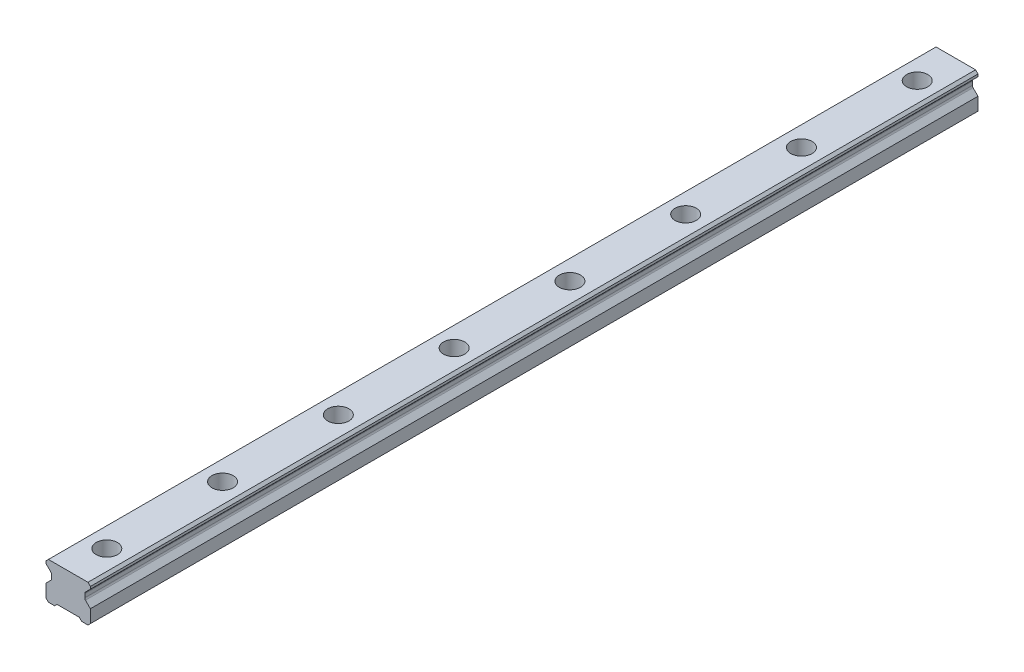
from build123d import *

# Parameters (mm, degrees)
SKETCH1_W           = 23
SKETCH1_H           = 19.2
BOSS_EXTRUDE1_DEPTH = 230
CUT_EXTRUDE1_DEPTH  = 461.544123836
CHAMFER1_SIZE       = 1.25
FILLET1_R           = 1.25
CUT_EXTRUDE2_DEPTH  = 461.544123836
SKETCH4_R           = 5.5
SKETCH4_R_2         = 3.5
CUT_EXTRUDE3_DEPTH  = 9
SKETCH4_2_R         = 3.5
CUT_EXTRUDE4_DEPTH  = 232.086325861
LPATTERN1_COUNT     = 8
LPATTERN1_PITCH     = 60


with BuildPart() as part:
    # Sketch1 → Boss-Extrude1 (new, symmetric)
    with BuildSketch(Plane.XY):
        with Locations((0, 9.6)):
            Rectangle(SKETCH1_W, SKETCH1_H)
    extrude(amount=BOSS_EXTRUDE1_DEPTH, both=True)

    # Sketch2 → Cut-Extrude1 (cut, through all)
    with BuildSketch(Plane.XY.offset(230)):
        Polygon((-11.5, 16.7), (-11.5, 7.95), (-8.583333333, 10.866666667), (-8.583333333, 13.783333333), align=None)
        Polygon((8.583333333, 13.783333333), (11.5, 16.7), (11.5, 7.95), (8.583333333, 10.866666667), align=None)
    extrude(amount=-CUT_EXTRUDE1_DEPTH, mode=Mode.SUBTRACT)

    # Chamfer1
    chamfer1_edges = [part.edges().sort_by_distance(p)[0] for p in [
        (-11.5, 19.2, 0),
        (11.5, 19.2, 0),
        (11.5, 0, 0),
        (-11.5, 0, 0),
    ]]
    chamfer(chamfer1_edges, length=CHAMFER1_SIZE)

    # Fillet1
    fillet1_edges = [part.edges().sort_by_distance(p)[0] for p in [
        (-8.583333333, 13.783333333, 0),
        (-8.583333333, 10.866666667, 0),
        (8.583333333, 10.866666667, 0),
        (8.583333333, 13.783333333, 0),
    ]]
    fillet(fillet1_edges, radius=FILLET1_R)

    # Sketch3 → Cut-Extrude2 (cut, through all)
    with BuildSketch(Plane.XY.offset(230)):
        Polygon((-7, 0), (-5.75, 1.25), (5.75, 1.25), (7, 0), align=None)
    extrude(amount=-CUT_EXTRUDE2_DEPTH, mode=Mode.SUBTRACT)

    # Sketch4 → Cut-Extrude3 (cut)
    with BuildSketch(Plane(origin=(0, 19.2, 0), x_dir=(1, 0, 0), z_dir=(0, 1, 0))):
        with Locations(Location((0, -210, 0), (0, 0, 270))):
            Circle(SKETCH4_R)
        with Locations(Location((0, -210, 0), (0, 0, 270))):
            Circle(SKETCH4_R_2, mode=Mode.SUBTRACT)
    cut_extrude3 = extrude(amount=-CUT_EXTRUDE3_DEPTH, mode=Mode.SUBTRACT)

    # Sketch4_2 → Cut-Extrude4 (cut, through all)
    with BuildSketch(Plane(origin=(0, 19.2, 0), x_dir=(1, 0, 0), z_dir=(0, 1, 0))):
        with Locations(Location((0, -210, 0), (0, 0, 270))):
            Circle(SKETCH4_2_R)
    cut_extrude4 = extrude(amount=-CUT_EXTRUDE4_DEPTH, mode=Mode.SUBTRACT)

    # LPattern1: Cut-Extrude3, Cut-Extrude4 ×8
    with Locations(*[(0, 0, -i * LPATTERN1_PITCH) for i in range(1, LPATTERN1_COUNT)]):
        add(cut_extrude3, mode=Mode.SUBTRACT)
        add(cut_extrude4, mode=Mode.SUBTRACT)


solid = part.part
